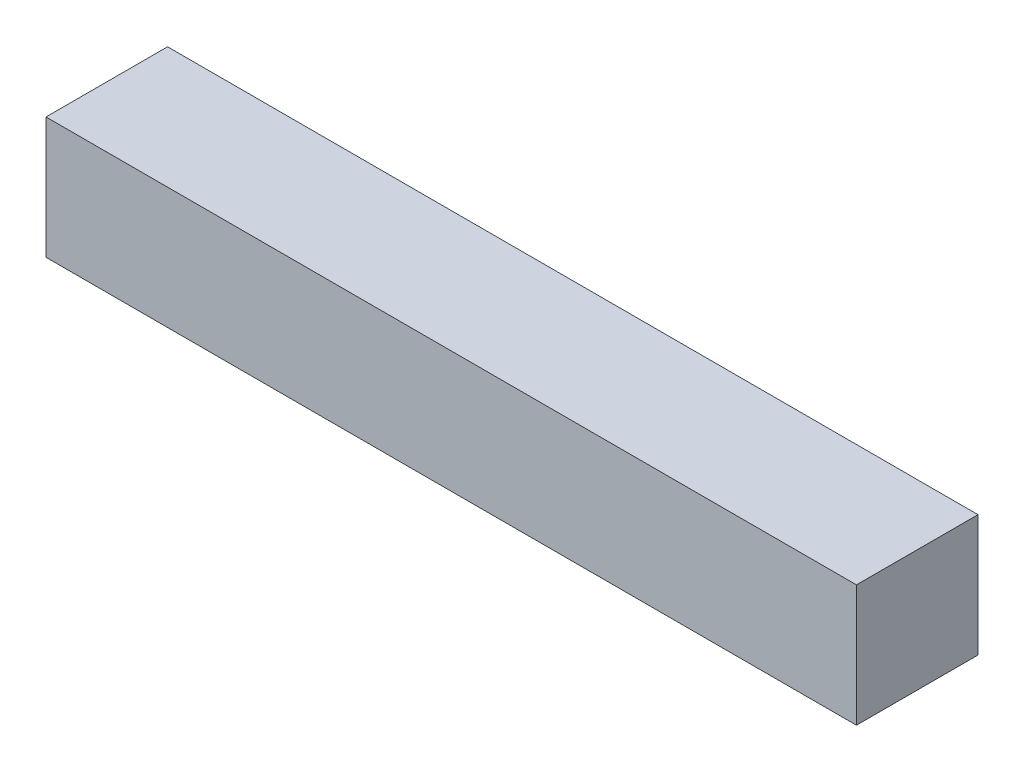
ISO-10303-21;
HEADER;
FILE_DESCRIPTION(('STEP AP214'),'2;1');
FILE_NAME('part.step','',(''),(''),'','','');
FILE_SCHEMA(('AUTOMOTIVE_DESIGN { 1 0 10303 214 1 1 1 1 }'));
ENDSEC;
DATA;
#1=APPLICATION_CONTEXT('core data for automotive mechanical design processes');
#2=APPLICATION_PROTOCOL_DEFINITION('international standard','automotive_design',2000,#1);
#3=PRODUCT_CONTEXT('',#1,'mechanical');
#4=PRODUCT('Part','Part','',(#3));
#5=PRODUCT_RELATED_PRODUCT_CATEGORY('part','',(#4));
#6=PRODUCT_DEFINITION_FORMATION('','',#4);
#7=PRODUCT_DEFINITION_CONTEXT('part definition',#1,'design');
#8=PRODUCT_DEFINITION('design','',#6,#7);
#9=PRODUCT_DEFINITION_SHAPE('','',#8);
#10=(LENGTH_UNIT() NAMED_UNIT(*) SI_UNIT(.MILLI.,.METRE.));
#11=(NAMED_UNIT(*) PLANE_ANGLE_UNIT() SI_UNIT($,.RADIAN.));
#12=(NAMED_UNIT(*) SI_UNIT($,.STERADIAN.) SOLID_ANGLE_UNIT());
#13=UNCERTAINTY_MEASURE_WITH_UNIT(LENGTH_MEASURE(1.E-05),#10,'distance_accuracy_value','');
#14=(GEOMETRIC_REPRESENTATION_CONTEXT(3) GLOBAL_UNCERTAINTY_ASSIGNED_CONTEXT((#13)) GLOBAL_UNIT_ASSIGNED_CONTEXT((#10,
#11,#12)) REPRESENTATION_CONTEXT('',''));
#15=CARTESIAN_POINT('',(0.,0.,0.));
#16=DIRECTION('',(0.,0.,1.));
#17=DIRECTION('',(1.,0.,0.));
#18=AXIS2_PLACEMENT_3D('',#15,#16,#17);
#19=CARTESIAN_POINT('',(-219.666676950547,150.,1345.77179744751));
#20=DIRECTION('',(0.,0.,1.));
#21=DIRECTION('',(1.,0.,0.));
#22=AXIS2_PLACEMENT_3D('',#19,#20,#21);
#23=PLANE('',#22);
#24=DIRECTION('',(-1.,0.,0.));
#25=VECTOR('',#24,1.);
#26=CARTESIAN_POINT('',(-219.666676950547,0.,1345.77179744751));
#27=LINE('',#26,#25);
#28=CARTESIAN_POINT('',(780.333323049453,0.,1345.77179744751));
#29=VERTEX_POINT('',#28);
#30=CARTESIAN_POINT('',(-219.666676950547,0.,1345.77179744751));
#31=VERTEX_POINT('',#30);
#32=EDGE_CURVE('E73',#29,#31,#27,.T.);
#33=ORIENTED_EDGE('',*,*,#32,.T.);
#34=DIRECTION('',(0.,-1.,0.));
#35=VECTOR('',#34,1.);
#36=CARTESIAN_POINT('',(-219.666676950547,150.,1345.77179744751));
#37=LINE('',#36,#35);
#38=CARTESIAN_POINT('',(-219.666676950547,150.,1345.77179744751));
#39=VERTEX_POINT('',#38);
#40=EDGE_CURVE('E11',#39,#31,#37,.T.);
#41=ORIENTED_EDGE('',*,*,#40,.F.);
#42=DIRECTION('',(-1.,0.,0.));
#43=VECTOR('',#42,1.);
#44=CARTESIAN_POINT('',(-219.666676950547,150.,1345.77179744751));
#45=LINE('',#44,#43);
#46=CARTESIAN_POINT('',(780.333323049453,150.,1345.77179744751));
#47=VERTEX_POINT('',#46);
#48=EDGE_CURVE('E91',#47,#39,#45,.T.);
#49=ORIENTED_EDGE('',*,*,#48,.F.);
#50=DIRECTION('',(0.,-1.,0.));
#51=VECTOR('',#50,1.);
#52=CARTESIAN_POINT('',(780.333323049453,150.,1345.77179744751));
#53=LINE('',#52,#51);
#54=EDGE_CURVE('E85',#47,#29,#53,.T.);
#55=ORIENTED_EDGE('',*,*,#54,.T.);
#56=EDGE_LOOP('',(#33,#41,#49,#55));
#57=FACE_BOUND('',#56,.T.);
#58=ADVANCED_FACE('F29',(#57),#23,.F.);
#59=CARTESIAN_POINT('',(-219.666676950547,150.,1345.77179744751));
#60=DIRECTION('',(1.,0.,0.));
#61=DIRECTION('',(0.,0.,-1.));
#62=AXIS2_PLACEMENT_3D('',#59,#60,#61);
#63=PLANE('',#62);
#64=DIRECTION('',(0.,0.,1.));
#65=VECTOR('',#64,1.);
#66=CARTESIAN_POINT('',(-219.666676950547,0.,1345.77179744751));
#67=LINE('',#66,#65);
#68=CARTESIAN_POINT('',(-219.666676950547,0.,1495.77179744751));
#69=VERTEX_POINT('',#68);
#70=EDGE_CURVE('E69',#31,#69,#67,.T.);
#71=ORIENTED_EDGE('',*,*,#70,.T.);
#72=DIRECTION('',(0.,-1.,0.));
#73=VECTOR('',#72,1.);
#74=CARTESIAN_POINT('',(-219.666676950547,150.,1495.77179744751));
#75=LINE('',#74,#73);
#76=CARTESIAN_POINT('',(-219.666676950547,150.,1495.77179744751));
#77=VERTEX_POINT('',#76);
#78=EDGE_CURVE('E36',#77,#69,#75,.T.);
#79=ORIENTED_EDGE('',*,*,#78,.F.);
#80=DIRECTION('',(0.,0.,1.));
#81=VECTOR('',#80,1.);
#82=CARTESIAN_POINT('',(-219.666676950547,150.,1345.77179744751));
#83=LINE('',#82,#81);
#84=EDGE_CURVE('E81',#39,#77,#83,.T.);
#85=ORIENTED_EDGE('',*,*,#84,.F.);
#86=ORIENTED_EDGE('',*,*,#40,.T.);
#87=EDGE_LOOP('',(#71,#79,#85,#86));
#88=FACE_BOUND('',#87,.T.);
#89=ADVANCED_FACE('F80',(#88),#63,.F.);
#90=CARTESIAN_POINT('',(-219.666676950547,150.,1495.77179744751));
#91=DIRECTION('',(0.,0.,-1.));
#92=DIRECTION('',(-1.,0.,0.));
#93=AXIS2_PLACEMENT_3D('',#90,#91,#92);
#94=PLANE('',#93);
#95=DIRECTION('',(1.,0.,0.));
#96=VECTOR('',#95,1.);
#97=CARTESIAN_POINT('',(-219.666676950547,0.,1495.77179744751));
#98=LINE('',#97,#96);
#99=CARTESIAN_POINT('',(780.333323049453,0.,1495.77179744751));
#100=VERTEX_POINT('',#99);
#101=EDGE_CURVE('E74',#69,#100,#98,.T.);
#102=ORIENTED_EDGE('',*,*,#101,.T.);
#103=DIRECTION('',(0.,-1.,0.));
#104=VECTOR('',#103,1.);
#105=CARTESIAN_POINT('',(780.333323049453,150.,1495.77179744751));
#106=LINE('',#105,#104);
#107=CARTESIAN_POINT('',(780.333323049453,150.,1495.77179744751));
#108=VERTEX_POINT('',#107);
#109=EDGE_CURVE('E97',#108,#100,#106,.T.);
#110=ORIENTED_EDGE('',*,*,#109,.F.);
#111=DIRECTION('',(1.,0.,0.));
#112=VECTOR('',#111,1.);
#113=CARTESIAN_POINT('',(-219.666676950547,150.,1495.77179744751));
#114=LINE('',#113,#112);
#115=EDGE_CURVE('E48',#77,#108,#114,.T.);
#116=ORIENTED_EDGE('',*,*,#115,.F.);
#117=ORIENTED_EDGE('',*,*,#78,.T.);
#118=EDGE_LOOP('',(#102,#110,#116,#117));
#119=FACE_BOUND('',#118,.T.);
#120=ADVANCED_FACE('F100',(#119),#94,.F.);
#121=CARTESIAN_POINT('',(780.333323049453,150.,1345.77179744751));
#122=DIRECTION('',(-1.,0.,0.));
#123=DIRECTION('',(0.,0.,1.));
#124=AXIS2_PLACEMENT_3D('',#121,#122,#123);
#125=PLANE('',#124);
#126=DIRECTION('',(0.,0.,-1.));
#127=VECTOR('',#126,1.);
#128=CARTESIAN_POINT('',(780.333323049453,0.,1345.77179744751));
#129=LINE('',#128,#127);
#130=EDGE_CURVE('E89',#100,#29,#129,.T.);
#131=ORIENTED_EDGE('',*,*,#130,.T.);
#132=ORIENTED_EDGE('',*,*,#54,.F.);
#133=DIRECTION('',(0.,0.,-1.));
#134=VECTOR('',#133,1.);
#135=CARTESIAN_POINT('',(780.333323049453,150.,1345.77179744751));
#136=LINE('',#135,#134);
#137=EDGE_CURVE('E43',#108,#47,#136,.T.);
#138=ORIENTED_EDGE('',*,*,#137,.F.);
#139=ORIENTED_EDGE('',*,*,#109,.T.);
#140=EDGE_LOOP('',(#131,#132,#138,#139));
#141=FACE_BOUND('',#140,.T.);
#142=ADVANCED_FACE('F102',(#141),#125,.F.);
#143=CARTESIAN_POINT('',(-219.666676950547,150.,1345.77179744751));
#144=DIRECTION('',(0.,-1.,0.));
#145=DIRECTION('',(0.,0.,-1.));
#146=AXIS2_PLACEMENT_3D('',#143,#144,#145);
#147=PLANE('',#146);
#148=ORIENTED_EDGE('',*,*,#48,.T.);
#149=ORIENTED_EDGE('',*,*,#84,.T.);
#150=ORIENTED_EDGE('',*,*,#115,.T.);
#151=ORIENTED_EDGE('',*,*,#137,.T.);
#152=EDGE_LOOP('',(#148,#149,#150,#151));
#153=FACE_BOUND('',#152,.T.);
#154=ADVANCED_FACE('F103',(#153),#147,.F.);
#155=CARTESIAN_POINT('',(-219.666676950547,0.,1345.77179744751));
#156=DIRECTION('',(0.,-1.,0.));
#157=DIRECTION('',(0.,0.,-1.));
#158=AXIS2_PLACEMENT_3D('',#155,#156,#157);
#159=PLANE('',#158);
#160=ORIENTED_EDGE('',*,*,#32,.F.);
#161=ORIENTED_EDGE('',*,*,#130,.F.);
#162=ORIENTED_EDGE('',*,*,#101,.F.);
#163=ORIENTED_EDGE('',*,*,#70,.F.);
#164=EDGE_LOOP('',(#160,#161,#162,#163));
#165=FACE_BOUND('',#164,.T.);
#166=ADVANCED_FACE('F70',(#165),#159,.T.);
#167=CLOSED_SHELL('',(#58,#89,#120,#142,#154,#166));
#168=MANIFOLD_SOLID_BREP('B2',#167);
#169=ADVANCED_BREP_SHAPE_REPRESENTATION('',(#18,#168),#14);
#170=SHAPE_DEFINITION_REPRESENTATION(#9,#169);
ENDSEC;
END-ISO-10303-21;
